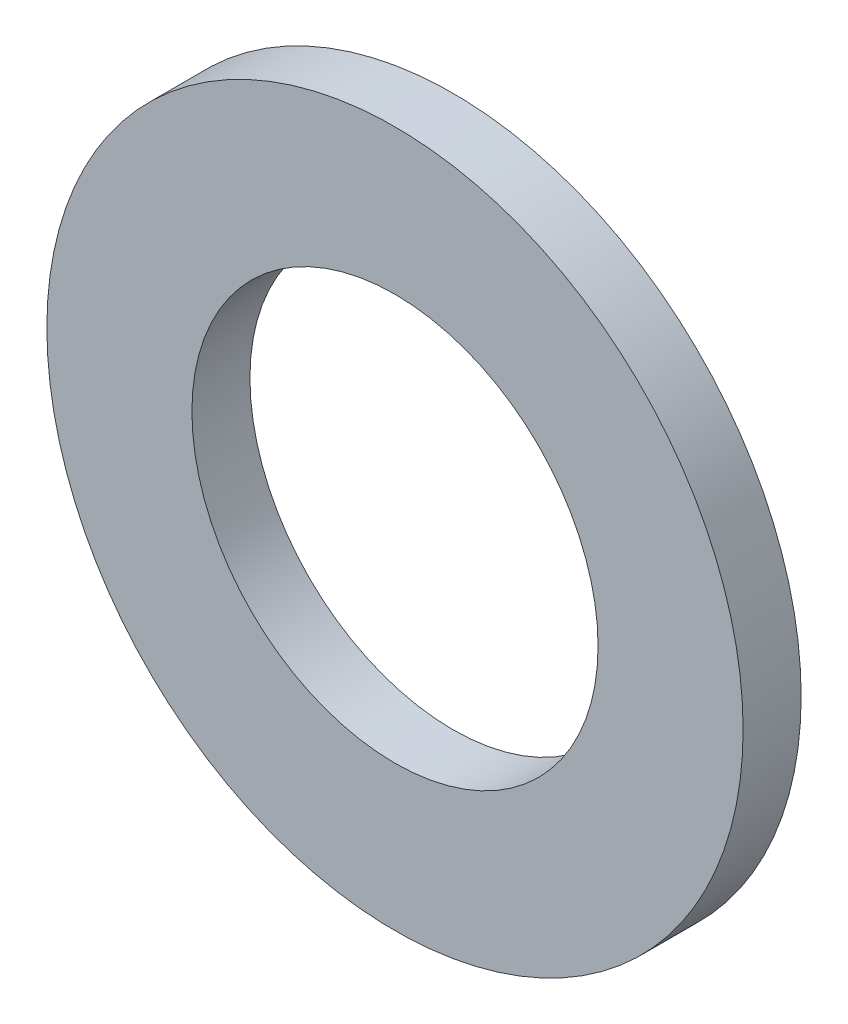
ISO-10303-21;
HEADER;
FILE_DESCRIPTION(('STEP AP214'),'2;1');
FILE_NAME('part.step','',(''),(''),'','','');
FILE_SCHEMA(('AUTOMOTIVE_DESIGN { 1 0 10303 214 1 1 1 1 }'));
ENDSEC;
DATA;
#1=APPLICATION_CONTEXT('core data for automotive mechanical design processes');
#2=APPLICATION_PROTOCOL_DEFINITION('international standard','automotive_design',2000,#1);
#3=PRODUCT_CONTEXT('',#1,'mechanical');
#4=PRODUCT('Part','Part','',(#3));
#5=PRODUCT_RELATED_PRODUCT_CATEGORY('part','',(#4));
#6=PRODUCT_DEFINITION_FORMATION('','',#4);
#7=PRODUCT_DEFINITION_CONTEXT('part definition',#1,'design');
#8=PRODUCT_DEFINITION('design','',#6,#7);
#9=PRODUCT_DEFINITION_SHAPE('','',#8);
#10=(LENGTH_UNIT() NAMED_UNIT(*) SI_UNIT(.MILLI.,.METRE.));
#11=(NAMED_UNIT(*) PLANE_ANGLE_UNIT() SI_UNIT($,.RADIAN.));
#12=(NAMED_UNIT(*) SI_UNIT($,.STERADIAN.) SOLID_ANGLE_UNIT());
#13=UNCERTAINTY_MEASURE_WITH_UNIT(LENGTH_MEASURE(1.E-05),#10,'distance_accuracy_value','');
#14=(GEOMETRIC_REPRESENTATION_CONTEXT(3) GLOBAL_UNCERTAINTY_ASSIGNED_CONTEXT((#13)) GLOBAL_UNIT_ASSIGNED_CONTEXT((#10,
#11,#12)) REPRESENTATION_CONTEXT('',''));
#15=CARTESIAN_POINT('',(0.,0.,0.));
#16=DIRECTION('',(0.,0.,1.));
#17=DIRECTION('',(1.,0.,0.));
#18=AXIS2_PLACEMENT_3D('',#15,#16,#17);
#19=CARTESIAN_POINT('',(0.,0.,3.));
#20=DIRECTION('',(0.,0.,1.));
#21=DIRECTION('',(1.,0.,0.));
#22=AXIS2_PLACEMENT_3D('',#19,#20,#21);
#23=PLANE('',#22);
#24=CARTESIAN_POINT('',(0.,0.,3.));
#25=DIRECTION('',(0.,0.,1.));
#26=DIRECTION('',(1.,0.,0.));
#27=AXIS2_PLACEMENT_3D('',#24,#25,#26);
#28=CIRCLE('',#27,18.);
#29=CARTESIAN_POINT('',(18.,0.,3.));
#30=VERTEX_POINT('',#29);
#31=EDGE_CURVE('E10',#30,#30,#28,.T.);
#32=ORIENTED_EDGE('',*,*,#31,.T.);
#33=EDGE_LOOP('',(#32));
#34=FACE_BOUND('',#33,.T.);
#35=CARTESIAN_POINT('',(0.,0.,3.));
#36=DIRECTION('',(0.,0.,1.));
#37=DIRECTION('',(1.,0.,0.));
#38=AXIS2_PLACEMENT_3D('',#35,#36,#37);
#39=CIRCLE('',#38,10.5);
#40=CARTESIAN_POINT('',(10.5,0.,3.));
#41=VERTEX_POINT('',#40);
#42=EDGE_CURVE('E40',#41,#41,#39,.T.);
#43=ORIENTED_EDGE('',*,*,#42,.F.);
#44=EDGE_LOOP('',(#43));
#45=FACE_BOUND('',#44,.T.);
#46=ADVANCED_FACE('F29',(#34,#45),#23,.T.);
#47=CARTESIAN_POINT('',(0.,0.,0.));
#48=DIRECTION('',(0.,0.,1.));
#49=DIRECTION('',(1.,0.,0.));
#50=AXIS2_PLACEMENT_3D('',#47,#48,#49);
#51=PLANE('',#50);
#52=CARTESIAN_POINT('',(0.,0.,0.));
#53=DIRECTION('',(0.,0.,1.));
#54=DIRECTION('',(1.,0.,0.));
#55=AXIS2_PLACEMENT_3D('',#52,#53,#54);
#56=CIRCLE('',#55,18.);
#57=CARTESIAN_POINT('',(18.,0.,0.));
#58=VERTEX_POINT('',#57);
#59=EDGE_CURVE('E36',#58,#58,#56,.T.);
#60=ORIENTED_EDGE('',*,*,#59,.F.);
#61=EDGE_LOOP('',(#60));
#62=FACE_BOUND('',#61,.T.);
#63=CARTESIAN_POINT('',(0.,0.,0.));
#64=DIRECTION('',(0.,0.,1.));
#65=DIRECTION('',(1.,0.,0.));
#66=AXIS2_PLACEMENT_3D('',#63,#64,#65);
#67=CIRCLE('',#66,10.5);
#68=CARTESIAN_POINT('',(10.5,0.,0.));
#69=VERTEX_POINT('',#68);
#70=EDGE_CURVE('E44',#69,#69,#67,.T.);
#71=ORIENTED_EDGE('',*,*,#70,.T.);
#72=EDGE_LOOP('',(#71));
#73=FACE_BOUND('',#72,.T.);
#74=ADVANCED_FACE('F50',(#62,#73),#51,.F.);
#75=CARTESIAN_POINT('',(0.,0.,3.));
#76=DIRECTION('',(0.,0.,-1.));
#77=DIRECTION('',(-1.,0.,0.));
#78=AXIS2_PLACEMENT_3D('',#75,#76,#77);
#79=CYLINDRICAL_SURFACE('',#78,18.);
#80=ORIENTED_EDGE('',*,*,#31,.F.);
#81=EDGE_LOOP('',(#80));
#82=FACE_BOUND('',#81,.T.);
#83=ORIENTED_EDGE('',*,*,#59,.T.);
#84=EDGE_LOOP('',(#83));
#85=FACE_BOUND('',#84,.T.);
#86=ADVANCED_FACE('F31',(#82,#85),#79,.T.);
#87=CARTESIAN_POINT('',(0.,0.,3.));
#88=DIRECTION('',(0.,0.,-1.));
#89=DIRECTION('',(-1.,0.,0.));
#90=AXIS2_PLACEMENT_3D('',#87,#88,#89);
#91=CYLINDRICAL_SURFACE('',#90,10.5);
#92=ORIENTED_EDGE('',*,*,#42,.T.);
#93=EDGE_LOOP('',(#92));
#94=FACE_BOUND('',#93,.T.);
#95=ORIENTED_EDGE('',*,*,#70,.F.);
#96=EDGE_LOOP('',(#95));
#97=FACE_BOUND('',#96,.T.);
#98=ADVANCED_FACE('F52',(#94,#97),#91,.F.);
#99=CLOSED_SHELL('',(#46,#74,#86,#98));
#100=MANIFOLD_SOLID_BREP('B2',#99);
#101=ADVANCED_BREP_SHAPE_REPRESENTATION('',(#18,#100),#14);
#102=SHAPE_DEFINITION_REPRESENTATION(#9,#101);
ENDSEC;
END-ISO-10303-21;
